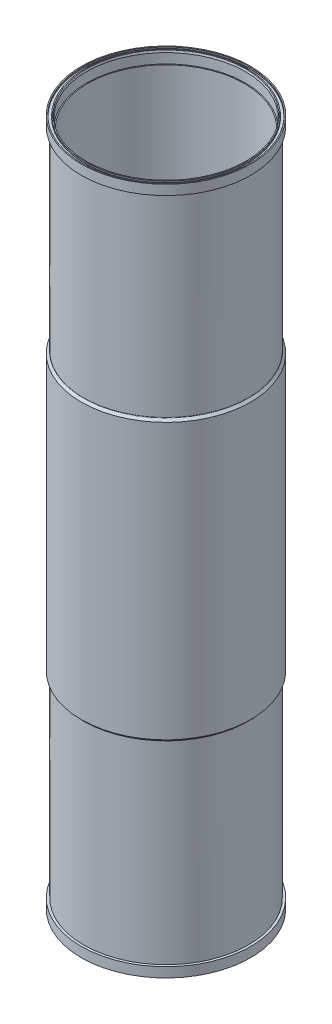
ISO-10303-21;
HEADER;
FILE_DESCRIPTION(('STEP AP214'),'2;1');
FILE_NAME('part.step','',(''),(''),'','','');
FILE_SCHEMA(('AUTOMOTIVE_DESIGN { 1 0 10303 214 1 1 1 1 }'));
ENDSEC;
DATA;
#1=APPLICATION_CONTEXT('core data for automotive mechanical design processes');
#2=APPLICATION_PROTOCOL_DEFINITION('international standard','automotive_design',2000,#1);
#3=PRODUCT_CONTEXT('',#1,'mechanical');
#4=PRODUCT('Part','Part','',(#3));
#5=PRODUCT_RELATED_PRODUCT_CATEGORY('part','',(#4));
#6=PRODUCT_DEFINITION_FORMATION('','',#4);
#7=PRODUCT_DEFINITION_CONTEXT('part definition',#1,'design');
#8=PRODUCT_DEFINITION('design','',#6,#7);
#9=PRODUCT_DEFINITION_SHAPE('','',#8);
#10=(LENGTH_UNIT() NAMED_UNIT(*) SI_UNIT(.MILLI.,.METRE.));
#11=(NAMED_UNIT(*) PLANE_ANGLE_UNIT() SI_UNIT($,.RADIAN.));
#12=(NAMED_UNIT(*) SI_UNIT($,.STERADIAN.) SOLID_ANGLE_UNIT());
#13=UNCERTAINTY_MEASURE_WITH_UNIT(LENGTH_MEASURE(1.E-05),#10,'distance_accuracy_value','');
#14=(GEOMETRIC_REPRESENTATION_CONTEXT(3) GLOBAL_UNCERTAINTY_ASSIGNED_CONTEXT((#13)) GLOBAL_UNIT_ASSIGNED_CONTEXT((#10,
#11,#12)) REPRESENTATION_CONTEXT('',''));
#15=CARTESIAN_POINT('',(0.,0.,0.));
#16=DIRECTION('',(0.,0.,1.));
#17=DIRECTION('',(1.,0.,0.));
#18=AXIS2_PLACEMENT_3D('',#15,#16,#17);
#19=CARTESIAN_POINT('',(-109.537499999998,0.,0.));
#20=DIRECTION('',(0.,1.,0.));
#21=DIRECTION('',(0.,0.,1.));
#22=AXIS2_PLACEMENT_3D('',#19,#20,#21);
#23=PLANE('',#22);
#24=CARTESIAN_POINT('',(0.,0.,0.));
#25=DIRECTION('',(0.,-1.,0.));
#26=DIRECTION('',(0.,0.,-1.));
#27=AXIS2_PLACEMENT_3D('',#24,#25,#26);
#28=CIRCLE('',#27,103.309290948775);
#29=CARTESIAN_POINT('',(0.,0.,-103.309290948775));
#30=VERTEX_POINT('',#29);
#31=EDGE_CURVE('E63',#30,#30,#28,.T.);
#32=ORIENTED_EDGE('',*,*,#31,.F.);
#33=EDGE_LOOP('',(#32));
#34=FACE_BOUND('',#33,.T.);
#35=CARTESIAN_POINT('',(0.,0.,0.));
#36=DIRECTION('',(0.,-1.,0.));
#37=DIRECTION('',(0.,0.,-1.));
#38=AXIS2_PLACEMENT_3D('',#35,#36,#37);
#39=CIRCLE('',#38,104.4829);
#40=CARTESIAN_POINT('',(0.,0.,-104.4829));
#41=VERTEX_POINT('',#40);
#42=EDGE_CURVE('E175',#41,#41,#39,.T.);
#43=ORIENTED_EDGE('',*,*,#42,.T.);
#44=EDGE_LOOP('',(#43));
#45=FACE_BOUND('',#44,.T.);
#46=ADVANCED_FACE('F55',(#34,#45),#23,.F.);
#47=CARTESIAN_POINT('',(-109.537499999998,889.,0.));
#48=DIRECTION('',(0.,-1.,0.));
#49=DIRECTION('',(0.,0.,-1.));
#50=AXIS2_PLACEMENT_3D('',#47,#48,#49);
#51=PLANE('',#50);
#52=CARTESIAN_POINT('',(0.,889.,0.));
#53=DIRECTION('',(0.,-1.,0.));
#54=DIRECTION('',(0.,0.,-1.));
#55=AXIS2_PLACEMENT_3D('',#52,#53,#54);
#56=CIRCLE('',#55,103.309290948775);
#57=CARTESIAN_POINT('',(0.,889.,-103.309290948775));
#58=VERTEX_POINT('',#57);
#59=EDGE_CURVE('E83',#58,#58,#56,.T.);
#60=ORIENTED_EDGE('',*,*,#59,.T.);
#61=EDGE_LOOP('',(#60));
#62=FACE_BOUND('',#61,.T.);
#63=CARTESIAN_POINT('',(0.,889.,0.));
#64=DIRECTION('',(0.,-1.,0.));
#65=DIRECTION('',(0.,0.,-1.));
#66=AXIS2_PLACEMENT_3D('',#63,#64,#65);
#67=CIRCLE('',#66,104.4829);
#68=CARTESIAN_POINT('',(0.,889.,-104.4829));
#69=VERTEX_POINT('',#68);
#70=EDGE_CURVE('E143',#69,#69,#67,.T.);
#71=ORIENTED_EDGE('',*,*,#70,.F.);
#72=EDGE_LOOP('',(#71));
#73=FACE_BOUND('',#72,.T.);
#74=ADVANCED_FACE('F262',(#62,#73),#51,.F.);
#75=CARTESIAN_POINT('',(0.,880.11,0.));
#76=DIRECTION('',(0.,1.,0.));
#77=DIRECTION('',(0.,0.,1.));
#78=AXIS2_PLACEMENT_3D('',#75,#76,#77);
#79=CYLINDRICAL_SURFACE('',#78,106.4387);
#80=CARTESIAN_POINT('',(0.,876.3,0.));
#81=DIRECTION('',(0.,1.,0.));
#82=DIRECTION('',(0.,0.,1.));
#83=AXIS2_PLACEMENT_3D('',#80,#81,#82);
#84=CIRCLE('',#83,106.4387);
#85=CARTESIAN_POINT('',(0.,876.3,106.4387));
#86=VERTEX_POINT('',#85);
#87=EDGE_CURVE('E116',#86,#86,#84,.T.);
#88=ORIENTED_EDGE('',*,*,#87,.F.);
#89=EDGE_LOOP('',(#88));
#90=FACE_BOUND('',#89,.T.);
#91=CARTESIAN_POINT('',(0.,625.727582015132,0.));
#92=DIRECTION('',(0.,1.,0.));
#93=DIRECTION('',(0.,0.,1.));
#94=AXIS2_PLACEMENT_3D('',#91,#92,#93);
#95=CIRCLE('',#94,106.4387);
#96=CARTESIAN_POINT('',(0.,625.727582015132,106.4387));
#97=VERTEX_POINT('',#96);
#98=EDGE_CURVE('E12',#97,#97,#95,.F.);
#99=ORIENTED_EDGE('',*,*,#98,.F.);
#100=EDGE_LOOP('',(#99));
#101=FACE_BOUND('',#100,.T.);
#102=ADVANCED_FACE('F254',(#90,#101),#79,.T.);
#103=CARTESIAN_POINT('',(0.,0.,0.));
#104=DIRECTION('',(0.,-1.,0.));
#105=DIRECTION('',(0.,0.,-1.));
#106=AXIS2_PLACEMENT_3D('',#103,#104,#105);
#107=CYLINDRICAL_SURFACE('',#106,109.537499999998);
#108=CARTESIAN_POINT('',(0.,12.7,0.));
#109=DIRECTION('',(0.,1.,0.));
#110=DIRECTION('',(0.,0.,1.));
#111=AXIS2_PLACEMENT_3D('',#108,#109,#110);
#112=CIRCLE('',#111,109.537499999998);
#113=CARTESIAN_POINT('',(0.,12.7,109.537499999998));
#114=VERTEX_POINT('',#113);
#115=EDGE_CURVE('E108',#114,#114,#112,.T.);
#116=ORIENTED_EDGE('',*,*,#115,.F.);
#117=EDGE_LOOP('',(#116));
#118=FACE_BOUND('',#117,.T.);
#119=CARTESIAN_POINT('',(0.,0.,0.));
#120=DIRECTION('',(0.,-1.,0.));
#121=DIRECTION('',(0.,0.,-1.));
#122=AXIS2_PLACEMENT_3D('',#119,#120,#121);
#123=CIRCLE('',#122,109.537499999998);
#124=CARTESIAN_POINT('',(0.,0.,-109.537499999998));
#125=VERTEX_POINT('',#124);
#126=EDGE_CURVE('E70',#125,#125,#123,.T.);
#127=ORIENTED_EDGE('',*,*,#126,.F.);
#128=EDGE_LOOP('',(#127));
#129=FACE_BOUND('',#128,.T.);
#130=ADVANCED_FACE('F252',(#118,#129),#107,.T.);
#131=CARTESIAN_POINT('',(0.,0.,0.));
#132=DIRECTION('',(0.,-1.,0.));
#133=DIRECTION('',(0.,0.,-1.));
#134=AXIS2_PLACEMENT_3D('',#131,#132,#133);
#135=CONICAL_SURFACE('',#134,103.309290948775,0.26179938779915);
#136=CARTESIAN_POINT('',(0.,2.54,0.));
#137=DIRECTION('',(0.,-1.,0.));
#138=DIRECTION('',(0.,0.,-1.));
#139=AXIS2_PLACEMENT_3D('',#136,#137,#138);
#140=CIRCLE('',#139,102.6287);
#141=CARTESIAN_POINT('',(0.,2.54,-102.6287));
#142=VERTEX_POINT('',#141);
#143=EDGE_CURVE('E105',#142,#142,#140,.T.);
#144=ORIENTED_EDGE('',*,*,#143,.F.);
#145=EDGE_LOOP('',(#144));
#146=FACE_BOUND('',#145,.T.);
#147=ORIENTED_EDGE('',*,*,#31,.T.);
#148=EDGE_LOOP('',(#147));
#149=FACE_BOUND('',#148,.T.);
#150=ADVANCED_FACE('F57',(#146,#149),#135,.F.);
#151=CARTESIAN_POINT('',(0.,0.,0.));
#152=DIRECTION('',(0.,-1.,0.));
#153=DIRECTION('',(0.,0.,-1.));
#154=AXIS2_PLACEMENT_3D('',#151,#152,#153);
#155=CIRCLE('',#154,108.2675);
#156=CARTESIAN_POINT('',(0.,0.,-108.2675));
#157=VERTEX_POINT('',#156);
#158=EDGE_CURVE('E179',#157,#157,#155,.T.);
#159=ORIENTED_EDGE('',*,*,#158,.F.);
#160=EDGE_LOOP('',(#159));
#161=FACE_BOUND('',#160,.T.);
#162=ORIENTED_EDGE('',*,*,#126,.T.);
#163=EDGE_LOOP('',(#162));
#164=FACE_BOUND('',#163,.T.);
#165=ADVANCED_FACE('F246',(#161,#164),#23,.F.);
#166=CARTESIAN_POINT('',(0.,876.3,0.));
#167=DIRECTION('',(0.,1.,0.));
#168=DIRECTION('',(0.,0.,1.));
#169=AXIS2_PLACEMENT_3D('',#166,#167,#168);
#170=CIRCLE('',#169,109.537499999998);
#171=CARTESIAN_POINT('',(0.,876.3,109.537499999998));
#172=VERTEX_POINT('',#171);
#173=EDGE_CURVE('E120',#172,#172,#170,.T.);
#174=ORIENTED_EDGE('',*,*,#173,.T.);
#175=EDGE_LOOP('',(#174));
#176=FACE_BOUND('',#175,.T.);
#177=CARTESIAN_POINT('',(0.,889.,0.));
#178=DIRECTION('',(0.,-1.,0.));
#179=DIRECTION('',(0.,0.,-1.));
#180=AXIS2_PLACEMENT_3D('',#177,#178,#179);
#181=CIRCLE('',#180,109.537499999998);
#182=CARTESIAN_POINT('',(0.,889.,-109.537499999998));
#183=VERTEX_POINT('',#182);
#184=EDGE_CURVE('E77',#183,#183,#181,.T.);
#185=ORIENTED_EDGE('',*,*,#184,.T.);
#186=EDGE_LOOP('',(#185));
#187=FACE_BOUND('',#186,.T.);
#188=ADVANCED_FACE('F249',(#176,#187),#107,.T.);
#189=CARTESIAN_POINT('',(0.,889.,0.));
#190=DIRECTION('',(0.,-1.,0.));
#191=DIRECTION('',(0.,0.,-1.));
#192=AXIS2_PLACEMENT_3D('',#189,#190,#191);
#193=CIRCLE('',#192,108.2675);
#194=CARTESIAN_POINT('',(0.,889.,-108.2675));
#195=VERTEX_POINT('',#194);
#196=EDGE_CURVE('E147',#195,#195,#193,.T.);
#197=ORIENTED_EDGE('',*,*,#196,.T.);
#198=EDGE_LOOP('',(#197));
#199=FACE_BOUND('',#198,.T.);
#200=ORIENTED_EDGE('',*,*,#184,.F.);
#201=EDGE_LOOP('',(#200));
#202=FACE_BOUND('',#201,.T.);
#203=ADVANCED_FACE('F269',(#199,#202),#51,.F.);
#204=CARTESIAN_POINT('',(0.,886.46,0.));
#205=DIRECTION('',(0.,1.,0.));
#206=DIRECTION('',(0.,0.,1.));
#207=AXIS2_PLACEMENT_3D('',#204,#205,#206);
#208=CONICAL_SURFACE('',#207,102.6287,0.261799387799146);
#209=ORIENTED_EDGE('',*,*,#59,.F.);
#210=EDGE_LOOP('',(#209));
#211=FACE_BOUND('',#210,.T.);
#212=CARTESIAN_POINT('',(0.,886.46,0.));
#213=DIRECTION('',(0.,-1.,0.));
#214=DIRECTION('',(0.,0.,-1.));
#215=AXIS2_PLACEMENT_3D('',#212,#213,#214);
#216=CIRCLE('',#215,102.6287);
#217=CARTESIAN_POINT('',(0.,886.46,-102.6287));
#218=VERTEX_POINT('',#217);
#219=EDGE_CURVE('E87',#218,#218,#216,.T.);
#220=ORIENTED_EDGE('',*,*,#219,.T.);
#221=EDGE_LOOP('',(#220));
#222=FACE_BOUND('',#221,.T.);
#223=ADVANCED_FACE('F362',(#211,#222),#208,.F.);
#224=CARTESIAN_POINT('',(0.,0.,0.));
#225=DIRECTION('',(0.,-1.,0.));
#226=DIRECTION('',(0.,0.,-1.));
#227=AXIS2_PLACEMENT_3D('',#224,#225,#226);
#228=CYLINDRICAL_SURFACE('',#227,102.6287);
#229=ORIENTED_EDGE('',*,*,#219,.F.);
#230=EDGE_LOOP('',(#229));
#231=FACE_BOUND('',#230,.T.);
#232=CARTESIAN_POINT('',(0.,873.76,0.));
#233=DIRECTION('',(0.,-1.,0.));
#234=DIRECTION('',(0.,0.,-1.));
#235=AXIS2_PLACEMENT_3D('',#232,#233,#234);
#236=CIRCLE('',#235,102.6287);
#237=CARTESIAN_POINT('',(0.,873.76,-102.6287));
#238=VERTEX_POINT('',#237);
#239=EDGE_CURVE('E91',#238,#238,#236,.T.);
#240=ORIENTED_EDGE('',*,*,#239,.T.);
#241=EDGE_LOOP('',(#240));
#242=FACE_BOUND('',#241,.T.);
#243=ADVANCED_FACE('F358',(#231,#242),#228,.F.);
#244=CARTESIAN_POINT('',(-102.6287,873.76,0.));
#245=DIRECTION('',(0.,-1.,0.));
#246=DIRECTION('',(0.,0.,-1.));
#247=AXIS2_PLACEMENT_3D('',#244,#245,#246);
#248=PLANE('',#247);
#249=ORIENTED_EDGE('',*,*,#239,.F.);
#250=EDGE_LOOP('',(#249));
#251=FACE_BOUND('',#250,.T.);
#252=CARTESIAN_POINT('',(0.,873.76,0.));
#253=DIRECTION('',(0.,-1.,0.));
#254=DIRECTION('',(0.,0.,-1.));
#255=AXIS2_PLACEMENT_3D('',#252,#253,#254);
#256=CIRCLE('',#255,101.3587);
#257=CARTESIAN_POINT('',(0.,873.76,-101.3587));
#258=VERTEX_POINT('',#257);
#259=EDGE_CURVE('E95',#258,#258,#256,.T.);
#260=ORIENTED_EDGE('',*,*,#259,.T.);
#261=EDGE_LOOP('',(#260));
#262=FACE_BOUND('',#261,.T.);
#263=ADVANCED_FACE('F354',(#251,#262),#248,.F.);
#264=CARTESIAN_POINT('',(0.,0.,0.));
#265=DIRECTION('',(0.,-1.,0.));
#266=DIRECTION('',(0.,0.,-1.));
#267=AXIS2_PLACEMENT_3D('',#264,#265,#266);
#268=CYLINDRICAL_SURFACE('',#267,101.3587);
#269=ORIENTED_EDGE('',*,*,#259,.F.);
#270=EDGE_LOOP('',(#269));
#271=FACE_BOUND('',#270,.T.);
#272=CARTESIAN_POINT('',(0.,15.24,0.));
#273=DIRECTION('',(0.,-1.,0.));
#274=DIRECTION('',(0.,0.,-1.));
#275=AXIS2_PLACEMENT_3D('',#272,#273,#274);
#276=CIRCLE('',#275,101.3587);
#277=CARTESIAN_POINT('',(0.,15.24,-101.3587));
#278=VERTEX_POINT('',#277);
#279=EDGE_CURVE('E99',#278,#278,#276,.T.);
#280=ORIENTED_EDGE('',*,*,#279,.T.);
#281=EDGE_LOOP('',(#280));
#282=FACE_BOUND('',#281,.T.);
#283=ADVANCED_FACE('F350',(#271,#282),#268,.F.);
#284=CARTESIAN_POINT('',(-102.6287,15.24,0.));
#285=DIRECTION('',(0.,1.,0.));
#286=DIRECTION('',(0.,0.,1.));
#287=AXIS2_PLACEMENT_3D('',#284,#285,#286);
#288=PLANE('',#287);
#289=ORIENTED_EDGE('',*,*,#279,.F.);
#290=EDGE_LOOP('',(#289));
#291=FACE_BOUND('',#290,.T.);
#292=CARTESIAN_POINT('',(0.,15.24,0.));
#293=DIRECTION('',(0.,-1.,0.));
#294=DIRECTION('',(0.,0.,-1.));
#295=AXIS2_PLACEMENT_3D('',#292,#293,#294);
#296=CIRCLE('',#295,102.6287);
#297=CARTESIAN_POINT('',(0.,15.24,-102.6287));
#298=VERTEX_POINT('',#297);
#299=EDGE_CURVE('E102',#298,#298,#296,.T.);
#300=ORIENTED_EDGE('',*,*,#299,.T.);
#301=EDGE_LOOP('',(#300));
#302=FACE_BOUND('',#301,.T.);
#303=ADVANCED_FACE('F346',(#291,#302),#288,.F.);
#304=CARTESIAN_POINT('',(0.,0.,0.));
#305=DIRECTION('',(0.,-1.,0.));
#306=DIRECTION('',(0.,0.,-1.));
#307=AXIS2_PLACEMENT_3D('',#304,#305,#306);
#308=CYLINDRICAL_SURFACE('',#307,102.6287);
#309=ORIENTED_EDGE('',*,*,#299,.F.);
#310=EDGE_LOOP('',(#309));
#311=FACE_BOUND('',#310,.T.);
#312=ORIENTED_EDGE('',*,*,#143,.T.);
#313=EDGE_LOOP('',(#312));
#314=FACE_BOUND('',#313,.T.);
#315=ADVANCED_FACE('F342',(#311,#314),#308,.F.);
#316=CARTESIAN_POINT('',(-109.537499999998,12.7,0.));
#317=DIRECTION('',(0.,-1.,0.));
#318=DIRECTION('',(0.,0.,-1.));
#319=AXIS2_PLACEMENT_3D('',#316,#317,#318);
#320=PLANE('',#319);
#321=CARTESIAN_POINT('',(0.,12.7,0.));
#322=DIRECTION('',(0.,1.,0.));
#323=DIRECTION('',(0.,0.,1.));
#324=AXIS2_PLACEMENT_3D('',#321,#322,#323);
#325=CIRCLE('',#324,106.4387);
#326=CARTESIAN_POINT('',(0.,12.7,106.4387));
#327=VERTEX_POINT('',#326);
#328=EDGE_CURVE('E112',#327,#327,#325,.T.);
#329=ORIENTED_EDGE('',*,*,#328,.F.);
#330=EDGE_LOOP('',(#329));
#331=FACE_BOUND('',#330,.T.);
#332=ORIENTED_EDGE('',*,*,#115,.T.);
#333=EDGE_LOOP('',(#332));
#334=FACE_BOUND('',#333,.T.);
#335=ADVANCED_FACE('F338',(#331,#334),#320,.F.);
#336=CARTESIAN_POINT('',(0.,263.272417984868,0.));
#337=DIRECTION('',(0.,-1.,0.));
#338=DIRECTION('',(0.,0.,-1.));
#339=AXIS2_PLACEMENT_3D('',#336,#337,#338);
#340=CIRCLE('',#339,106.4387);
#341=CARTESIAN_POINT('',(0.,263.272417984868,-106.4387));
#342=VERTEX_POINT('',#341);
#343=EDGE_CURVE('E139',#342,#342,#340,.T.);
#344=ORIENTED_EDGE('',*,*,#343,.T.);
#345=EDGE_LOOP('',(#344));
#346=FACE_BOUND('',#345,.T.);
#347=ORIENTED_EDGE('',*,*,#328,.T.);
#348=EDGE_LOOP('',(#347));
#349=FACE_BOUND('',#348,.T.);
#350=ADVANCED_FACE('F265',(#346,#349),#79,.T.);
#351=CARTESIAN_POINT('',(-109.537499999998,876.3,0.));
#352=DIRECTION('',(0.,1.,0.));
#353=DIRECTION('',(0.,0.,1.));
#354=AXIS2_PLACEMENT_3D('',#351,#352,#353);
#355=PLANE('',#354);
#356=ORIENTED_EDGE('',*,*,#173,.F.);
#357=EDGE_LOOP('',(#356));
#358=FACE_BOUND('',#357,.T.);
#359=ORIENTED_EDGE('',*,*,#87,.T.);
#360=EDGE_LOOP('',(#359));
#361=FACE_BOUND('',#360,.T.);
#362=ADVANCED_FACE('F332',(#358,#361),#355,.F.);
#363=CARTESIAN_POINT('',(0.,625.727582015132,0.));
#364=DIRECTION('',(0.,-1.,0.));
#365=DIRECTION('',(0.,0.,-1.));
#366=AXIS2_PLACEMENT_3D('',#363,#364,#365);
#367=TOROIDAL_SURFACE('',#366,107.23245,0.793749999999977);
#368=CARTESIAN_POINT('',(0.,625.166316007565,0.));
#369=DIRECTION('',(0.,-1.,0.));
#370=DIRECTION('',(0.,0.,-1.));
#371=AXIS2_PLACEMENT_3D('',#368,#369,#370);
#372=CIRCLE('',#371,106.671183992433);
#373=CARTESIAN_POINT('',(0.,625.166316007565,-106.671183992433));
#374=VERTEX_POINT('',#373);
#375=EDGE_CURVE('E124',#374,#374,#372,.T.);
#376=ORIENTED_EDGE('',*,*,#375,.F.);
#377=EDGE_LOOP('',(#376));
#378=FACE_BOUND('',#377,.T.);
#379=ORIENTED_EDGE('',*,*,#98,.T.);
#380=EDGE_LOOP('',(#379));
#381=FACE_BOUND('',#380,.T.);
#382=ADVANCED_FACE('F328',(#378,#381),#367,.F.);
#383=CARTESIAN_POINT('',(0.,625.166316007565,0.));
#384=DIRECTION('',(0.,-1.,0.));
#385=DIRECTION('',(0.,0.,-1.));
#386=AXIS2_PLACEMENT_3D('',#383,#384,#385);
#387=CONICAL_SURFACE('',#386,106.671183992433,0.785398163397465);
#388=CARTESIAN_POINT('',(0.,622.3,0.));
#389=DIRECTION('',(0.,-1.,0.));
#390=DIRECTION('',(0.,0.,-1.));
#391=AXIS2_PLACEMENT_3D('',#388,#389,#390);
#392=CIRCLE('',#391,109.537499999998);
#393=CARTESIAN_POINT('',(0.,622.3,-109.537499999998));
#394=VERTEX_POINT('',#393);
#395=EDGE_CURVE('E127',#394,#394,#392,.T.);
#396=ORIENTED_EDGE('',*,*,#395,.F.);
#397=EDGE_LOOP('',(#396));
#398=FACE_BOUND('',#397,.T.);
#399=ORIENTED_EDGE('',*,*,#375,.T.);
#400=EDGE_LOOP('',(#399));
#401=FACE_BOUND('',#400,.T.);
#402=ADVANCED_FACE('F324',(#398,#401),#387,.T.);
#403=CARTESIAN_POINT('',(0.,12.7,0.));
#404=DIRECTION('',(0.,-1.,0.));
#405=DIRECTION('',(0.,0.,-1.));
#406=AXIS2_PLACEMENT_3D('',#403,#404,#405);
#407=CYLINDRICAL_SURFACE('',#406,109.537499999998);
#408=CARTESIAN_POINT('',(0.,266.7,0.));
#409=DIRECTION('',(0.,-1.,0.));
#410=DIRECTION('',(0.,0.,-1.));
#411=AXIS2_PLACEMENT_3D('',#408,#409,#410);
#412=CIRCLE('',#411,109.537499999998);
#413=CARTESIAN_POINT('',(0.,266.7,-109.537499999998));
#414=VERTEX_POINT('',#413);
#415=EDGE_CURVE('E131',#414,#414,#412,.T.);
#416=ORIENTED_EDGE('',*,*,#415,.F.);
#417=EDGE_LOOP('',(#416));
#418=FACE_BOUND('',#417,.T.);
#419=ORIENTED_EDGE('',*,*,#395,.T.);
#420=EDGE_LOOP('',(#419));
#421=FACE_BOUND('',#420,.T.);
#422=ADVANCED_FACE('F320',(#418,#421),#407,.T.);
#423=CARTESIAN_POINT('',(0.,266.7,0.));
#424=DIRECTION('',(0.,1.,0.));
#425=DIRECTION('',(0.,0.,1.));
#426=AXIS2_PLACEMENT_3D('',#423,#424,#425);
#427=CONICAL_SURFACE('',#426,109.537499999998,0.785398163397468);
#428=CARTESIAN_POINT('',(0.,263.833683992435,0.));
#429=DIRECTION('',(0.,-1.,0.));
#430=DIRECTION('',(0.,0.,-1.));
#431=AXIS2_PLACEMENT_3D('',#428,#429,#430);
#432=CIRCLE('',#431,106.671183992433);
#433=CARTESIAN_POINT('',(0.,263.833683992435,-106.671183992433));
#434=VERTEX_POINT('',#433);
#435=EDGE_CURVE('E135',#434,#434,#432,.T.);
#436=ORIENTED_EDGE('',*,*,#435,.F.);
#437=EDGE_LOOP('',(#436));
#438=FACE_BOUND('',#437,.T.);
#439=ORIENTED_EDGE('',*,*,#415,.T.);
#440=EDGE_LOOP('',(#439));
#441=FACE_BOUND('',#440,.T.);
#442=ADVANCED_FACE('F316',(#438,#441),#427,.T.);
#443=CARTESIAN_POINT('',(0.,263.272417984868,0.));
#444=DIRECTION('',(0.,-1.,0.));
#445=DIRECTION('',(0.,0.,-1.));
#446=AXIS2_PLACEMENT_3D('',#443,#444,#445);
#447=TOROIDAL_SURFACE('',#446,107.23245,0.793749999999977);
#448=ORIENTED_EDGE('',*,*,#343,.F.);
#449=EDGE_LOOP('',(#448));
#450=FACE_BOUND('',#449,.T.);
#451=ORIENTED_EDGE('',*,*,#435,.T.);
#452=EDGE_LOOP('',(#451));
#453=FACE_BOUND('',#452,.T.);
#454=ADVANCED_FACE('F312',(#450,#453),#447,.F.);
#455=CARTESIAN_POINT('',(0.,888.873,0.));
#456=DIRECTION('',(0.,-1.,0.));
#457=DIRECTION('',(0.,0.,-1.));
#458=AXIS2_PLACEMENT_3D('',#455,#456,#457);
#459=TOROIDAL_SURFACE('',#458,104.4829,0.127000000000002);
#460=ORIENTED_EDGE('',*,*,#70,.T.);
#461=EDGE_LOOP('',(#460));
#462=FACE_BOUND('',#461,.T.);
#463=CARTESIAN_POINT('',(0.,888.873,0.));
#464=DIRECTION('',(0.,-1.,0.));
#465=DIRECTION('',(0.,0.,-1.));
#466=AXIS2_PLACEMENT_3D('',#463,#464,#465);
#467=CIRCLE('',#466,104.6099);
#468=CARTESIAN_POINT('',(0.,888.873,-104.6099));
#469=VERTEX_POINT('',#468);
#470=EDGE_CURVE('E171',#469,#469,#467,.T.);
#471=ORIENTED_EDGE('',*,*,#470,.F.);
#472=EDGE_LOOP('',(#471));
#473=FACE_BOUND('',#472,.T.);
#474=ADVANCED_FACE('F308',(#462,#473),#459,.T.);
#475=CARTESIAN_POINT('',(0.,888.873,0.));
#476=DIRECTION('',(0.,-1.,0.));
#477=DIRECTION('',(0.,0.,-1.));
#478=AXIS2_PLACEMENT_3D('',#475,#476,#477);
#479=TOROIDAL_SURFACE('',#478,108.2675,0.127000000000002);
#480=CARTESIAN_POINT('',(0.,888.873,0.));
#481=DIRECTION('',(0.,-1.,0.));
#482=DIRECTION('',(0.,0.,-1.));
#483=AXIS2_PLACEMENT_3D('',#480,#481,#482);
#484=CIRCLE('',#483,108.1405);
#485=CARTESIAN_POINT('',(0.,888.873,-108.1405));
#486=VERTEX_POINT('',#485);
#487=EDGE_CURVE('E151',#486,#486,#484,.T.);
#488=ORIENTED_EDGE('',*,*,#487,.T.);
#489=EDGE_LOOP('',(#488));
#490=FACE_BOUND('',#489,.T.);
#491=ORIENTED_EDGE('',*,*,#196,.F.);
#492=EDGE_LOOP('',(#491));
#493=FACE_BOUND('',#492,.T.);
#494=ADVANCED_FACE('F304',(#490,#493),#479,.T.);
#495=CARTESIAN_POINT('',(0.,0.,0.));
#496=DIRECTION('',(0.,-1.,0.));
#497=DIRECTION('',(0.,0.,-1.));
#498=AXIS2_PLACEMENT_3D('',#495,#496,#497);
#499=CYLINDRICAL_SURFACE('',#498,108.1405);
#500=CARTESIAN_POINT('',(0.,887.2982,0.));
#501=DIRECTION('',(0.,-1.,0.));
#502=DIRECTION('',(0.,0.,-1.));
#503=AXIS2_PLACEMENT_3D('',#500,#501,#502);
#504=CIRCLE('',#503,108.1405);
#505=CARTESIAN_POINT('',(0.,887.2982,-108.1405));
#506=VERTEX_POINT('',#505);
#507=EDGE_CURVE('E155',#506,#506,#504,.T.);
#508=ORIENTED_EDGE('',*,*,#507,.T.);
#509=EDGE_LOOP('',(#508));
#510=FACE_BOUND('',#509,.T.);
#511=ORIENTED_EDGE('',*,*,#487,.F.);
#512=EDGE_LOOP('',(#511));
#513=FACE_BOUND('',#512,.T.);
#514=ADVANCED_FACE('F300',(#510,#513),#499,.F.);
#515=CARTESIAN_POINT('',(0.,887.2982,0.));
#516=DIRECTION('',(0.,-1.,0.));
#517=DIRECTION('',(0.,0.,-1.));
#518=AXIS2_PLACEMENT_3D('',#515,#516,#517);
#519=TOROIDAL_SURFACE('',#518,107.8865,0.25399999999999);
#520=CARTESIAN_POINT('',(0.,887.0442,0.));
#521=DIRECTION('',(0.,-1.,0.));
#522=DIRECTION('',(0.,0.,-1.));
#523=AXIS2_PLACEMENT_3D('',#520,#521,#522);
#524=CIRCLE('',#523,107.8865);
#525=CARTESIAN_POINT('',(0.,887.0442,-107.8865));
#526=VERTEX_POINT('',#525);
#527=EDGE_CURVE('E159',#526,#526,#524,.T.);
#528=ORIENTED_EDGE('',*,*,#527,.T.);
#529=EDGE_LOOP('',(#528));
#530=FACE_BOUND('',#529,.T.);
#531=ORIENTED_EDGE('',*,*,#507,.F.);
#532=EDGE_LOOP('',(#531));
#533=FACE_BOUND('',#532,.T.);
#534=ADVANCED_FACE('F296',(#530,#533),#519,.F.);
#535=CARTESIAN_POINT('',(-104.8639,887.0442,0.));
#536=DIRECTION('',(0.,1.,0.));
#537=DIRECTION('',(0.,0.,1.));
#538=AXIS2_PLACEMENT_3D('',#535,#536,#537);
#539=PLANE('',#538);
#540=CARTESIAN_POINT('',(0.,887.0442,0.));
#541=DIRECTION('',(0.,-1.,0.));
#542=DIRECTION('',(0.,0.,-1.));
#543=AXIS2_PLACEMENT_3D('',#540,#541,#542);
#544=CIRCLE('',#543,104.8639);
#545=CARTESIAN_POINT('',(0.,887.0442,-104.8639));
#546=VERTEX_POINT('',#545);
#547=EDGE_CURVE('E163',#546,#546,#544,.T.);
#548=ORIENTED_EDGE('',*,*,#547,.T.);
#549=EDGE_LOOP('',(#548));
#550=FACE_BOUND('',#549,.T.);
#551=ORIENTED_EDGE('',*,*,#527,.F.);
#552=EDGE_LOOP('',(#551));
#553=FACE_BOUND('',#552,.T.);
#554=ADVANCED_FACE('F292',(#550,#553),#539,.T.);
#555=CARTESIAN_POINT('',(0.,887.2982,0.));
#556=DIRECTION('',(0.,-1.,0.));
#557=DIRECTION('',(0.,0.,-1.));
#558=AXIS2_PLACEMENT_3D('',#555,#556,#557);
#559=TOROIDAL_SURFACE('',#558,104.8639,0.25399999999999);
#560=CARTESIAN_POINT('',(0.,887.2982,0.));
#561=DIRECTION('',(0.,-1.,0.));
#562=DIRECTION('',(0.,0.,-1.));
#563=AXIS2_PLACEMENT_3D('',#560,#561,#562);
#564=CIRCLE('',#563,104.6099);
#565=CARTESIAN_POINT('',(0.,887.2982,-104.6099));
#566=VERTEX_POINT('',#565);
#567=EDGE_CURVE('E167',#566,#566,#564,.T.);
#568=ORIENTED_EDGE('',*,*,#567,.T.);
#569=EDGE_LOOP('',(#568));
#570=FACE_BOUND('',#569,.T.);
#571=ORIENTED_EDGE('',*,*,#547,.F.);
#572=EDGE_LOOP('',(#571));
#573=FACE_BOUND('',#572,.T.);
#574=ADVANCED_FACE('F286',(#570,#573),#559,.F.);
#575=CARTESIAN_POINT('',(0.,0.,0.));
#576=DIRECTION('',(0.,-1.,0.));
#577=DIRECTION('',(0.,0.,-1.));
#578=AXIS2_PLACEMENT_3D('',#575,#576,#577);
#579=CYLINDRICAL_SURFACE('',#578,104.6099);
#580=ORIENTED_EDGE('',*,*,#470,.T.);
#581=EDGE_LOOP('',(#580));
#582=FACE_BOUND('',#581,.T.);
#583=ORIENTED_EDGE('',*,*,#567,.F.);
#584=EDGE_LOOP('',(#583));
#585=FACE_BOUND('',#584,.T.);
#586=ADVANCED_FACE('F281',(#582,#585),#579,.T.);
#587=CARTESIAN_POINT('',(0.,0.126999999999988,0.));
#588=DIRECTION('',(0.,1.,0.));
#589=DIRECTION('',(0.,0.,-1.));
#590=AXIS2_PLACEMENT_3D('',#587,#588,#589);
#591=TOROIDAL_SURFACE('',#590,104.4829,0.127000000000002);
#592=ORIENTED_EDGE('',*,*,#42,.F.);
#593=EDGE_LOOP('',(#592));
#594=FACE_BOUND('',#593,.T.);
#595=CARTESIAN_POINT('',(0.,0.126999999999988,0.));
#596=DIRECTION('',(0.,-1.,0.));
#597=DIRECTION('',(0.,0.,-1.));
#598=AXIS2_PLACEMENT_3D('',#595,#596,#597);
#599=CIRCLE('',#598,104.6099);
#600=CARTESIAN_POINT('',(0.,0.126999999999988,-104.6099));
#601=VERTEX_POINT('',#600);
#602=EDGE_CURVE('E203',#601,#601,#599,.T.);
#603=ORIENTED_EDGE('',*,*,#602,.T.);
#604=EDGE_LOOP('',(#603));
#605=FACE_BOUND('',#604,.T.);
#606=ADVANCED_FACE('F208',(#594,#605),#591,.T.);
#607=CARTESIAN_POINT('',(0.,0.126999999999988,0.));
#608=DIRECTION('',(0.,1.,0.));
#609=DIRECTION('',(0.,0.,-1.));
#610=AXIS2_PLACEMENT_3D('',#607,#608,#609);
#611=TOROIDAL_SURFACE('',#610,108.2675,0.127000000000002);
#612=CARTESIAN_POINT('',(0.,0.126999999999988,0.));
#613=DIRECTION('',(0.,-1.,0.));
#614=DIRECTION('',(0.,0.,-1.));
#615=AXIS2_PLACEMENT_3D('',#612,#613,#614);
#616=CIRCLE('',#615,108.1405);
#617=CARTESIAN_POINT('',(0.,0.126999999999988,-108.1405));
#618=VERTEX_POINT('',#617);
#619=EDGE_CURVE('E183',#618,#618,#616,.T.);
#620=ORIENTED_EDGE('',*,*,#619,.F.);
#621=EDGE_LOOP('',(#620));
#622=FACE_BOUND('',#621,.T.);
#623=ORIENTED_EDGE('',*,*,#158,.T.);
#624=EDGE_LOOP('',(#623));
#625=FACE_BOUND('',#624,.T.);
#626=ADVANCED_FACE('F237',(#622,#625),#611,.T.);
#627=CARTESIAN_POINT('',(0.,889.,0.));
#628=DIRECTION('',(0.,1.,0.));
#629=DIRECTION('',(0.,0.,-1.));
#630=AXIS2_PLACEMENT_3D('',#627,#628,#629);
#631=CYLINDRICAL_SURFACE('',#630,108.1405);
#632=CARTESIAN_POINT('',(0.,1.70179999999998,0.));
#633=DIRECTION('',(0.,-1.,0.));
#634=DIRECTION('',(0.,0.,-1.));
#635=AXIS2_PLACEMENT_3D('',#632,#633,#634);
#636=CIRCLE('',#635,108.1405);
#637=CARTESIAN_POINT('',(0.,1.70179999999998,-108.1405));
#638=VERTEX_POINT('',#637);
#639=EDGE_CURVE('E187',#638,#638,#636,.T.);
#640=ORIENTED_EDGE('',*,*,#639,.F.);
#641=EDGE_LOOP('',(#640));
#642=FACE_BOUND('',#641,.T.);
#643=ORIENTED_EDGE('',*,*,#619,.T.);
#644=EDGE_LOOP('',(#643));
#645=FACE_BOUND('',#644,.T.);
#646=ADVANCED_FACE('F231',(#642,#645),#631,.F.);
#647=CARTESIAN_POINT('',(0.,1.70179999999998,0.));
#648=DIRECTION('',(0.,1.,0.));
#649=DIRECTION('',(0.,0.,-1.));
#650=AXIS2_PLACEMENT_3D('',#647,#648,#649);
#651=TOROIDAL_SURFACE('',#650,107.8865,0.25399999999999);
#652=CARTESIAN_POINT('',(0.,1.95579999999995,0.));
#653=DIRECTION('',(0.,-1.,0.));
#654=DIRECTION('',(0.,0.,-1.));
#655=AXIS2_PLACEMENT_3D('',#652,#653,#654);
#656=CIRCLE('',#655,107.8865);
#657=CARTESIAN_POINT('',(0.,1.95579999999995,-107.8865));
#658=VERTEX_POINT('',#657);
#659=EDGE_CURVE('E191',#658,#658,#656,.T.);
#660=ORIENTED_EDGE('',*,*,#659,.F.);
#661=EDGE_LOOP('',(#660));
#662=FACE_BOUND('',#661,.T.);
#663=ORIENTED_EDGE('',*,*,#639,.T.);
#664=EDGE_LOOP('',(#663));
#665=FACE_BOUND('',#664,.T.);
#666=ADVANCED_FACE('F225',(#662,#665),#651,.F.);
#667=CARTESIAN_POINT('',(-104.8639,1.95579999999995,0.));
#668=DIRECTION('',(0.,-1.,0.));
#669=DIRECTION('',(0.,0.,1.));
#670=AXIS2_PLACEMENT_3D('',#667,#668,#669);
#671=PLANE('',#670);
#672=CARTESIAN_POINT('',(0.,1.95579999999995,0.));
#673=DIRECTION('',(0.,-1.,0.));
#674=DIRECTION('',(0.,0.,-1.));
#675=AXIS2_PLACEMENT_3D('',#672,#673,#674);
#676=CIRCLE('',#675,104.8639);
#677=CARTESIAN_POINT('',(0.,1.95579999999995,-104.8639));
#678=VERTEX_POINT('',#677);
#679=EDGE_CURVE('E195',#678,#678,#676,.T.);
#680=ORIENTED_EDGE('',*,*,#679,.F.);
#681=EDGE_LOOP('',(#680));
#682=FACE_BOUND('',#681,.T.);
#683=ORIENTED_EDGE('',*,*,#659,.T.);
#684=EDGE_LOOP('',(#683));
#685=FACE_BOUND('',#684,.T.);
#686=ADVANCED_FACE('F219',(#682,#685),#671,.T.);
#687=CARTESIAN_POINT('',(0.,1.70179999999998,0.));
#688=DIRECTION('',(0.,1.,0.));
#689=DIRECTION('',(0.,0.,-1.));
#690=AXIS2_PLACEMENT_3D('',#687,#688,#689);
#691=TOROIDAL_SURFACE('',#690,104.8639,0.25399999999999);
#692=CARTESIAN_POINT('',(0.,1.70179999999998,0.));
#693=DIRECTION('',(0.,-1.,0.));
#694=DIRECTION('',(0.,0.,-1.));
#695=AXIS2_PLACEMENT_3D('',#692,#693,#694);
#696=CIRCLE('',#695,104.6099);
#697=CARTESIAN_POINT('',(0.,1.70179999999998,-104.6099));
#698=VERTEX_POINT('',#697);
#699=EDGE_CURVE('E199',#698,#698,#696,.T.);
#700=ORIENTED_EDGE('',*,*,#699,.F.);
#701=EDGE_LOOP('',(#700));
#702=FACE_BOUND('',#701,.T.);
#703=ORIENTED_EDGE('',*,*,#679,.T.);
#704=EDGE_LOOP('',(#703));
#705=FACE_BOUND('',#704,.T.);
#706=ADVANCED_FACE('F213',(#702,#705),#691,.F.);
#707=CARTESIAN_POINT('',(0.,889.,0.));
#708=DIRECTION('',(0.,1.,0.));
#709=DIRECTION('',(0.,0.,-1.));
#710=AXIS2_PLACEMENT_3D('',#707,#708,#709);
#711=CYLINDRICAL_SURFACE('',#710,104.6099);
#712=ORIENTED_EDGE('',*,*,#602,.F.);
#713=EDGE_LOOP('',(#712));
#714=FACE_BOUND('',#713,.T.);
#715=ORIENTED_EDGE('',*,*,#699,.T.);
#716=EDGE_LOOP('',(#715));
#717=FACE_BOUND('',#716,.T.);
#718=ADVANCED_FACE('F210',(#714,#717),#711,.T.);
#719=CLOSED_SHELL('',(#46,#74,#102,#130,#150,#165,#188,#203,#223,#243,#263,#283,#303,#315,#335,
#350,#362,#382,#402,#422,#442,#454,#474,#494,#514,#534,#554,#574,#586,#606,#626,#646,#666,#686,
#706,#718));
#720=MANIFOLD_SOLID_BREP('B2',#719);
#721=ADVANCED_BREP_SHAPE_REPRESENTATION('',(#18,#720),#14);
#722=SHAPE_DEFINITION_REPRESENTATION(#9,#721);
ENDSEC;
END-ISO-10303-21;
